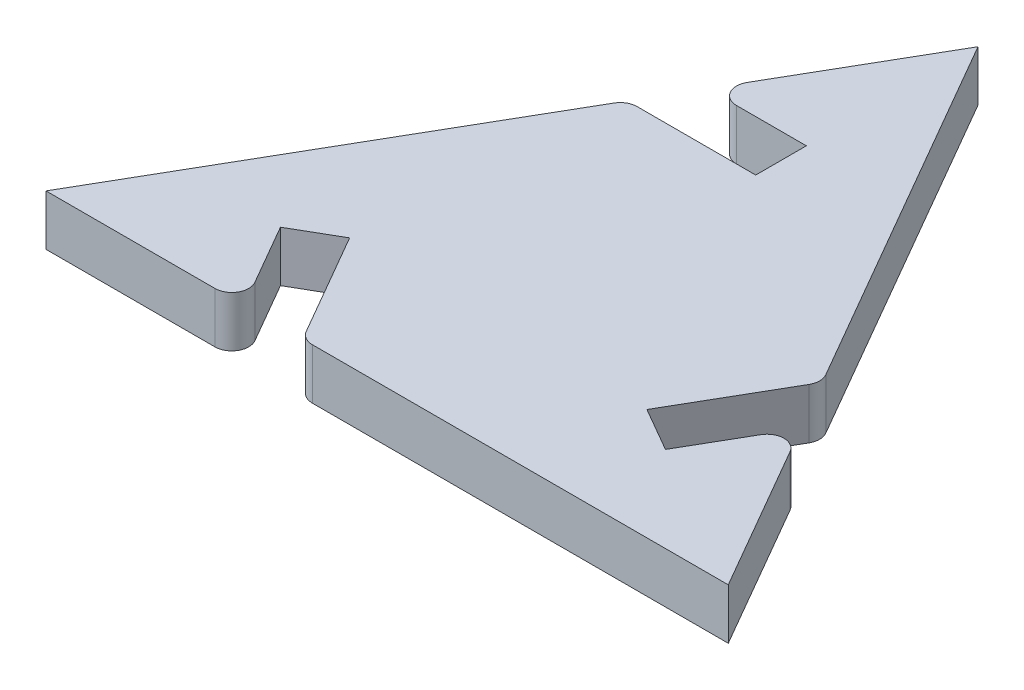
from build123d import *

# Parameters (mm, degrees)
SALIENTE_EXTRUIR1_DEPTH = 6
CROQUIS2_W              = 70
CROQUIS2_H              = 6
CORTAR_EXTRUIR1_DEPTH   = 63.025084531
MATRIZC1_COUNT          = 3
REDONDEO1_R             = 2


with BuildPart() as part:
    # Croquis1 → Saliente-Extruir1 (new body)
    with BuildSketch(Plane(origin=(0, 0, 0), x_dir=(1, 0, 0), z_dir=(0, 1, 0))):
        Polygon((0, 46.666666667), (-40.414518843, -23.333333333), (40.414518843, -23.333333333), align=None)
    extrude(amount=SALIENTE_EXTRUIR1_DEPTH)

    # Croquis2 → Cortar-Extruir1 (cut, through all)
    with BuildSketch(Plane(origin=(0, 6, 0), x_dir=(1, 0, 0), z_dir=(0, 1, 0))):
        with Locations((-35, 23.333333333)):
            Rectangle(CROQUIS2_W, CROQUIS2_H)
    cortar_extruir1 = extrude(amount=-CORTAR_EXTRUIR1_DEPTH, mode=Mode.SUBTRACT)

    # MatrizC1: Cortar-Extruir1 ×3 about axis
    matrizc1_axis = Axis((0, 0, 0), (0, 1, 0))
    for i in range(1, MATRIZC1_COUNT):
        add(cortar_extruir1.rotate(matrizc1_axis, i * 360 / MATRIZC1_COUNT), mode=Mode.SUBTRACT)

    # Redondeo1
    redondeo1_edges = [part.edges().sort_by_distance(p)[0] for p in [
        (-15.203557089, 3, -20.333333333),
        (-11.739455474, 3, -26.333333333),
        (-10.007404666, 3, 23.333333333),
        (-16.935607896, 3, 23.333333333),
        (25.210961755, 3, -3),
        (28.67506337, 3, 3),
    ]]
    fillet(redondeo1_edges, radius=REDONDEO1_R)


solid = part.part
